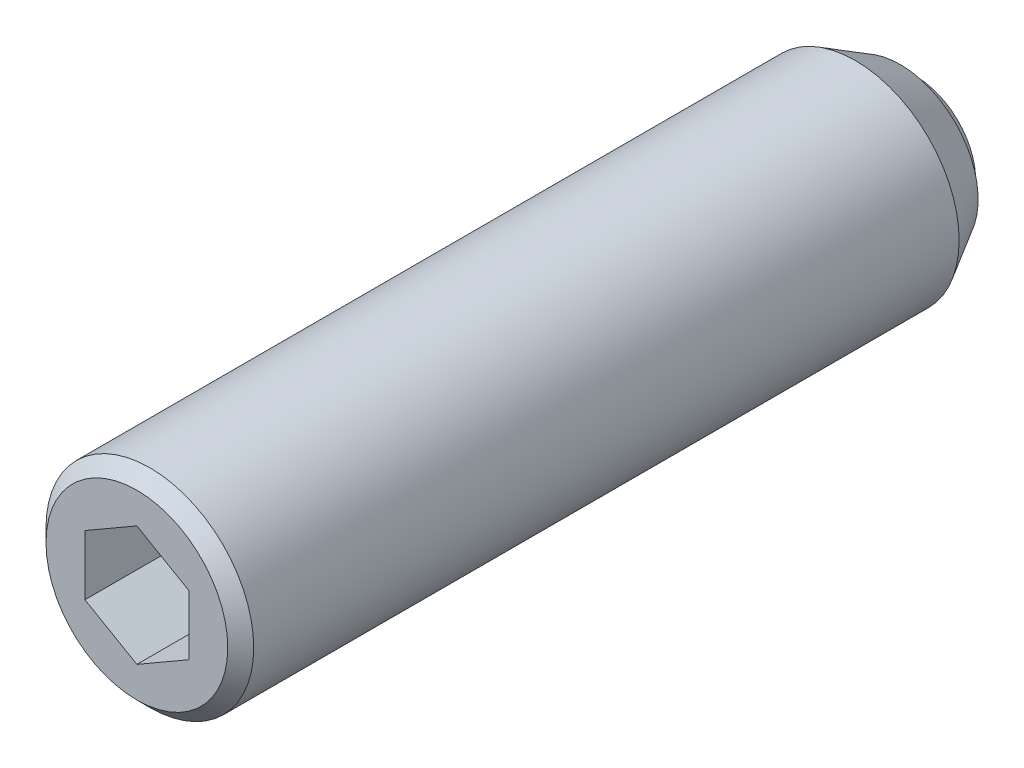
ISO-10303-21;
HEADER;
FILE_DESCRIPTION(('STEP AP214'),'2;1');
FILE_NAME('part.step','',(''),(''),'','','');
FILE_SCHEMA(('AUTOMOTIVE_DESIGN { 1 0 10303 214 1 1 1 1 }'));
ENDSEC;
DATA;
#1=APPLICATION_CONTEXT('core data for automotive mechanical design processes');
#2=APPLICATION_PROTOCOL_DEFINITION('international standard','automotive_design',2000,#1);
#3=PRODUCT_CONTEXT('',#1,'mechanical');
#4=PRODUCT('Part','Part','',(#3));
#5=PRODUCT_RELATED_PRODUCT_CATEGORY('part','',(#4));
#6=PRODUCT_DEFINITION_FORMATION('','',#4);
#7=PRODUCT_DEFINITION_CONTEXT('part definition',#1,'design');
#8=PRODUCT_DEFINITION('design','',#6,#7);
#9=PRODUCT_DEFINITION_SHAPE('','',#8);
#10=(LENGTH_UNIT() NAMED_UNIT(*) SI_UNIT(.MILLI.,.METRE.));
#11=(NAMED_UNIT(*) PLANE_ANGLE_UNIT() SI_UNIT($,.RADIAN.));
#12=(NAMED_UNIT(*) SI_UNIT($,.STERADIAN.) SOLID_ANGLE_UNIT());
#13=UNCERTAINTY_MEASURE_WITH_UNIT(LENGTH_MEASURE(1.E-05),#10,'distance_accuracy_value','');
#14=(GEOMETRIC_REPRESENTATION_CONTEXT(3) GLOBAL_UNCERTAINTY_ASSIGNED_CONTEXT((#13)) GLOBAL_UNIT_ASSIGNED_CONTEXT((#10,
#11,#12)) REPRESENTATION_CONTEXT('',''));
#15=CARTESIAN_POINT('',(0.,0.,0.));
#16=DIRECTION('',(0.,0.,1.));
#17=DIRECTION('',(1.,0.,0.));
#18=AXIS2_PLACEMENT_3D('',#15,#16,#17);
#19=CARTESIAN_POINT('',(2.,1.15470053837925,27.5));
#20=DIRECTION('',(0.5,0.86602540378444,0.));
#21=DIRECTION('',(0.86602540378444,-0.5,0.));
#22=AXIS2_PLACEMENT_3D('',#19,#20,#21);
#23=PLANE('',#22);
#24=DIRECTION('',(0.,0.,1.));
#25=VECTOR('',#24,1.);
#26=CARTESIAN_POINT('',(2.,1.15470053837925,27.5));
#27=LINE('',#26,#25);
#28=CARTESIAN_POINT('',(2.,1.15470053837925,26.));
#29=VERTEX_POINT('',#28);
#30=CARTESIAN_POINT('',(2.,1.15470053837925,30.));
#31=VERTEX_POINT('',#30);
#32=EDGE_CURVE('E68',#29,#31,#27,.T.);
#33=ORIENTED_EDGE('',*,*,#32,.T.);
#34=DIRECTION('',(-0.86602540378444,0.5,0.));
#35=VECTOR('',#34,1.);
#36=CARTESIAN_POINT('',(2.,1.15470053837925,30.));
#37=LINE('',#36,#35);
#38=CARTESIAN_POINT('',(0.,2.3094010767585,30.));
#39=VERTEX_POINT('',#38);
#40=EDGE_CURVE('E29',#31,#39,#37,.T.);
#41=ORIENTED_EDGE('',*,*,#40,.T.);
#42=DIRECTION('',(0.,0.,1.));
#43=VECTOR('',#42,1.);
#44=CARTESIAN_POINT('',(0.,2.3094010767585,27.5));
#45=LINE('',#44,#43);
#46=CARTESIAN_POINT('',(0.,2.3094010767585,26.));
#47=VERTEX_POINT('',#46);
#48=EDGE_CURVE('E80',#47,#39,#45,.T.);
#49=ORIENTED_EDGE('',*,*,#48,.F.);
#50=DIRECTION('',(-0.86602540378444,0.5,0.));
#51=VECTOR('',#50,1.);
#52=CARTESIAN_POINT('',(2.,1.15470053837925,26.));
#53=LINE('',#52,#51);
#54=EDGE_CURVE('E79',#29,#47,#53,.T.);
#55=ORIENTED_EDGE('',*,*,#54,.F.);
#56=EDGE_LOOP('',(#33,#41,#49,#55));
#57=FACE_BOUND('',#56,.T.);
#58=ADVANCED_FACE('F14',(#57),#23,.F.);
#59=CARTESIAN_POINT('',(2.,-1.15470053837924,27.5));
#60=DIRECTION('',(1.,0.,0.));
#61=DIRECTION('',(0.,0.,1.));
#62=AXIS2_PLACEMENT_3D('',#59,#60,#61);
#63=PLANE('',#62);
#64=DIRECTION('',(0.,0.,1.));
#65=VECTOR('',#64,1.);
#66=CARTESIAN_POINT('',(2.,-1.15470053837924,27.5));
#67=LINE('',#66,#65);
#68=CARTESIAN_POINT('',(2.,-1.15470053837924,26.));
#69=VERTEX_POINT('',#68);
#70=CARTESIAN_POINT('',(2.,-1.15470053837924,30.));
#71=VERTEX_POINT('',#70);
#72=EDGE_CURVE('E76',#69,#71,#67,.T.);
#73=ORIENTED_EDGE('',*,*,#72,.T.);
#74=DIRECTION('',(0.,1.,0.));
#75=VECTOR('',#74,1.);
#76=CARTESIAN_POINT('',(2.,-1.15470053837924,30.));
#77=LINE('',#76,#75);
#78=EDGE_CURVE('E75',#71,#31,#77,.T.);
#79=ORIENTED_EDGE('',*,*,#78,.T.);
#80=ORIENTED_EDGE('',*,*,#32,.F.);
#81=DIRECTION('',(0.,1.,0.));
#82=VECTOR('',#81,1.);
#83=CARTESIAN_POINT('',(2.,-1.15470053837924,26.));
#84=LINE('',#83,#82);
#85=EDGE_CURVE('E72',#69,#29,#84,.T.);
#86=ORIENTED_EDGE('',*,*,#85,.F.);
#87=EDGE_LOOP('',(#73,#79,#80,#86));
#88=FACE_BOUND('',#87,.T.);
#89=ADVANCED_FACE('F70',(#88),#63,.F.);
#90=CARTESIAN_POINT('',(2.,-1.15470053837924,27.5));
#91=DIRECTION('',(-0.5,0.866025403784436,0.));
#92=DIRECTION('',(0.866025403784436,0.5,0.));
#93=AXIS2_PLACEMENT_3D('',#90,#91,#92);
#94=PLANE('',#93);
#95=DIRECTION('',(0.,0.,1.));
#96=VECTOR('',#95,1.);
#97=CARTESIAN_POINT('',(0.,-2.30940107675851,27.5));
#98=LINE('',#97,#96);
#99=CARTESIAN_POINT('',(0.,-2.30940107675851,26.));
#100=VERTEX_POINT('',#99);
#101=CARTESIAN_POINT('',(0.,-2.30940107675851,30.));
#102=VERTEX_POINT('',#101);
#103=EDGE_CURVE('E122',#100,#102,#98,.T.);
#104=ORIENTED_EDGE('',*,*,#103,.T.);
#105=DIRECTION('',(-0.866025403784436,-0.5,0.));
#106=VECTOR('',#105,1.);
#107=CARTESIAN_POINT('',(2.,-1.15470053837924,30.));
#108=LINE('',#107,#106);
#109=EDGE_CURVE('E113',#71,#102,#108,.T.);
#110=ORIENTED_EDGE('',*,*,#109,.F.);
#111=ORIENTED_EDGE('',*,*,#72,.F.);
#112=DIRECTION('',(0.866025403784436,0.5,0.));
#113=VECTOR('',#112,1.);
#114=CARTESIAN_POINT('',(0.,-2.30940107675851,26.));
#115=LINE('',#114,#113);
#116=EDGE_CURVE('E89',#100,#69,#115,.T.);
#117=ORIENTED_EDGE('',*,*,#116,.F.);
#118=EDGE_LOOP('',(#104,#110,#111,#117));
#119=FACE_BOUND('',#118,.T.);
#120=ADVANCED_FACE('F147',(#119),#94,.T.);
#121=CARTESIAN_POINT('',(-2.,-1.15470053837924,27.5));
#122=DIRECTION('',(-0.5,-0.866025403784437,0.));
#123=DIRECTION('',(-0.866025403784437,0.5,0.));
#124=AXIS2_PLACEMENT_3D('',#121,#122,#123);
#125=PLANE('',#124);
#126=DIRECTION('',(0.,0.,1.));
#127=VECTOR('',#126,1.);
#128=CARTESIAN_POINT('',(-2.,-1.15470053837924,27.5));
#129=LINE('',#128,#127);
#130=CARTESIAN_POINT('',(-2.,-1.15470053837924,26.));
#131=VERTEX_POINT('',#130);
#132=CARTESIAN_POINT('',(-2.,-1.15470053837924,30.));
#133=VERTEX_POINT('',#132);
#134=EDGE_CURVE('E120',#131,#133,#129,.T.);
#135=ORIENTED_EDGE('',*,*,#134,.T.);
#136=DIRECTION('',(0.866025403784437,-0.5,0.));
#137=VECTOR('',#136,1.);
#138=CARTESIAN_POINT('',(-2.,-1.15470053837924,30.));
#139=LINE('',#138,#137);
#140=EDGE_CURVE('E111',#133,#102,#139,.T.);
#141=ORIENTED_EDGE('',*,*,#140,.T.);
#142=ORIENTED_EDGE('',*,*,#103,.F.);
#143=DIRECTION('',(0.866025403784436,-0.5,0.));
#144=VECTOR('',#143,1.);
#145=CARTESIAN_POINT('',(-2.,-1.15470053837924,26.));
#146=LINE('',#145,#144);
#147=EDGE_CURVE('E101',#131,#100,#146,.T.);
#148=ORIENTED_EDGE('',*,*,#147,.F.);
#149=EDGE_LOOP('',(#135,#141,#142,#148));
#150=FACE_BOUND('',#149,.T.);
#151=ADVANCED_FACE('F157',(#150),#125,.F.);
#152=CARTESIAN_POINT('',(-2.,-1.15470053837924,27.5));
#153=DIRECTION('',(1.,0.,0.));
#154=DIRECTION('',(0.,0.,1.));
#155=AXIS2_PLACEMENT_3D('',#152,#153,#154);
#156=PLANE('',#155);
#157=DIRECTION('',(0.,0.,1.));
#158=VECTOR('',#157,1.);
#159=CARTESIAN_POINT('',(-2.,1.15470053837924,27.5));
#160=LINE('',#159,#158);
#161=CARTESIAN_POINT('',(-2.,1.15470053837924,26.));
#162=VERTEX_POINT('',#161);
#163=CARTESIAN_POINT('',(-2.,1.15470053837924,30.));
#164=VERTEX_POINT('',#163);
#165=EDGE_CURVE('E37',#162,#164,#160,.T.);
#166=ORIENTED_EDGE('',*,*,#165,.T.);
#167=DIRECTION('',(0.,1.,0.));
#168=VECTOR('',#167,1.);
#169=CARTESIAN_POINT('',(-2.,-1.15470053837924,30.));
#170=LINE('',#169,#168);
#171=EDGE_CURVE('E108',#133,#164,#170,.T.);
#172=ORIENTED_EDGE('',*,*,#171,.F.);
#173=ORIENTED_EDGE('',*,*,#134,.F.);
#174=DIRECTION('',(0.,-1.,0.));
#175=VECTOR('',#174,1.);
#176=CARTESIAN_POINT('',(-2.,1.15470053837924,26.));
#177=LINE('',#176,#175);
#178=EDGE_CURVE('E98',#162,#131,#177,.T.);
#179=ORIENTED_EDGE('',*,*,#178,.F.);
#180=EDGE_LOOP('',(#166,#172,#173,#179));
#181=FACE_BOUND('',#180,.T.);
#182=ADVANCED_FACE('F153',(#181),#156,.T.);
#183=CARTESIAN_POINT('',(-2.,1.15470053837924,27.5));
#184=DIRECTION('',(0.5,-0.866025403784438,0.));
#185=DIRECTION('',(-0.866025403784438,-0.5,0.));
#186=AXIS2_PLACEMENT_3D('',#183,#184,#185);
#187=PLANE('',#186);
#188=ORIENTED_EDGE('',*,*,#165,.F.);
#189=DIRECTION('',(-0.866025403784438,-0.5,0.));
#190=VECTOR('',#189,1.);
#191=CARTESIAN_POINT('',(0.,2.3094010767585,26.));
#192=LINE('',#191,#190);
#193=EDGE_CURVE('E84',#47,#162,#192,.T.);
#194=ORIENTED_EDGE('',*,*,#193,.F.);
#195=ORIENTED_EDGE('',*,*,#48,.T.);
#196=DIRECTION('',(0.866025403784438,0.5,0.));
#197=VECTOR('',#196,1.);
#198=CARTESIAN_POINT('',(-2.,1.15470053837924,30.));
#199=LINE('',#198,#197);
#200=EDGE_CURVE('E105',#164,#39,#199,.T.);
#201=ORIENTED_EDGE('',*,*,#200,.F.);
#202=EDGE_LOOP('',(#188,#194,#195,#201));
#203=FACE_BOUND('',#202,.T.);
#204=ADVANCED_FACE('F150',(#203),#187,.T.);
#205=CARTESIAN_POINT('',(0.,0.,29.75));
#206=DIRECTION('',(0.,0.,-1.));
#207=DIRECTION('',(1.,0.,0.));
#208=AXIS2_PLACEMENT_3D('',#205,#206,#207);
#209=CYLINDRICAL_SURFACE('',#208,4.);
#210=CARTESIAN_POINT('',(0.,0.,29.5));
#211=DIRECTION('',(0.,0.,-1.));
#212=DIRECTION('',(1.,0.,0.));
#213=AXIS2_PLACEMENT_3D('',#210,#211,#212);
#214=CIRCLE('',#213,4.);
#215=CARTESIAN_POINT('',(4.,0.,29.5));
#216=VERTEX_POINT('',#215);
#217=EDGE_CURVE('E9',#216,#216,#214,.T.);
#218=ORIENTED_EDGE('',*,*,#217,.T.);
#219=EDGE_LOOP('',(#218));
#220=FACE_BOUND('',#219,.T.);
#221=CARTESIAN_POINT('',(0.,0.,2.33205080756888));
#222=DIRECTION('',(0.,0.,-1.));
#223=DIRECTION('',(-1.,0.,0.));
#224=AXIS2_PLACEMENT_3D('',#221,#222,#223);
#225=CIRCLE('',#224,4.);
#226=CARTESIAN_POINT('',(-4.,0.,2.33205080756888));
#227=VERTEX_POINT('',#226);
#228=EDGE_CURVE('E260',#227,#227,#225,.T.);
#229=ORIENTED_EDGE('',*,*,#228,.F.);
#230=EDGE_LOOP('',(#229));
#231=FACE_BOUND('',#230,.T.);
#232=ADVANCED_FACE('F16',(#220,#231),#209,.T.);
#233=CARTESIAN_POINT('',(0.,0.,29.5));
#234=DIRECTION('',(0.,0.,-1.));
#235=DIRECTION('',(1.,0.,0.));
#236=AXIS2_PLACEMENT_3D('',#233,#234,#235);
#237=CONICAL_SURFACE('',#236,4.,0.785398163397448);
#238=CARTESIAN_POINT('',(0.,0.,30.));
#239=DIRECTION('',(0.,0.,-1.));
#240=DIRECTION('',(1.,0.,0.));
#241=AXIS2_PLACEMENT_3D('',#238,#239,#240);
#242=CIRCLE('',#241,3.5);
#243=CARTESIAN_POINT('',(3.5,0.,30.));
#244=VERTEX_POINT('',#243);
#245=EDGE_CURVE('E22',#244,#244,#242,.T.);
#246=ORIENTED_EDGE('',*,*,#245,.T.);
#247=EDGE_LOOP('',(#246));
#248=FACE_BOUND('',#247,.T.);
#249=ORIENTED_EDGE('',*,*,#217,.F.);
#250=EDGE_LOOP('',(#249));
#251=FACE_BOUND('',#250,.T.);
#252=ADVANCED_FACE('F127',(#248,#251),#237,.T.);
#253=CARTESIAN_POINT('',(0.,0.,30.));
#254=DIRECTION('',(0.,0.,-1.));
#255=DIRECTION('',(1.,0.,0.));
#256=AXIS2_PLACEMENT_3D('',#253,#254,#255);
#257=PLANE('',#256);
#258=ORIENTED_EDGE('',*,*,#200,.T.);
#259=ORIENTED_EDGE('',*,*,#40,.F.);
#260=ORIENTED_EDGE('',*,*,#78,.F.);
#261=ORIENTED_EDGE('',*,*,#109,.T.);
#262=ORIENTED_EDGE('',*,*,#140,.F.);
#263=ORIENTED_EDGE('',*,*,#171,.T.);
#264=EDGE_LOOP('',(#258,#259,#260,#261,#262,#263));
#265=FACE_BOUND('',#264,.T.);
#266=ORIENTED_EDGE('',*,*,#245,.F.);
#267=EDGE_LOOP('',(#266));
#268=FACE_BOUND('',#267,.T.);
#269=ADVANCED_FACE('F130',(#265,#268),#257,.F.);
#270=CARTESIAN_POINT('',(2.,1.15470053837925,26.));
#271=DIRECTION('',(0.,0.,1.));
#272=DIRECTION('',(1.,0.,0.));
#273=AXIS2_PLACEMENT_3D('',#270,#271,#272);
#274=PLANE('',#273);
#275=ORIENTED_EDGE('',*,*,#85,.T.);
#276=ORIENTED_EDGE('',*,*,#54,.T.);
#277=ORIENTED_EDGE('',*,*,#193,.T.);
#278=ORIENTED_EDGE('',*,*,#178,.T.);
#279=ORIENTED_EDGE('',*,*,#147,.T.);
#280=ORIENTED_EDGE('',*,*,#116,.T.);
#281=EDGE_LOOP('',(#275,#276,#277,#278,#279,#280));
#282=FACE_BOUND('',#281,.T.);
#283=ADVANCED_FACE('F86',(#282),#274,.T.);
#284=CARTESIAN_POINT('',(0.,0.,0.));
#285=DIRECTION('',(0.,0.,-1.));
#286=DIRECTION('',(-1.,0.,0.));
#287=AXIS2_PLACEMENT_3D('',#284,#285,#286);
#288=PLANE('',#287);
#289=CARTESIAN_POINT('',(0.,0.,0.));
#290=DIRECTION('',(0.,0.,-1.));
#291=DIRECTION('',(-1.,0.,0.));
#292=AXIS2_PLACEMENT_3D('',#289,#290,#291);
#293=CIRCLE('',#292,2.30488611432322);
#294=CARTESIAN_POINT('',(-2.30488611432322,0.,0.));
#295=VERTEX_POINT('',#294);
#296=EDGE_CURVE('E90',#295,#295,#293,.T.);
#297=ORIENTED_EDGE('',*,*,#296,.T.);
#298=EDGE_LOOP('',(#297));
#299=FACE_BOUND('',#298,.T.);
#300=ADVANCED_FACE('F139',(#299),#288,.T.);
#301=CARTESIAN_POINT('',(0.,0.,1.5));
#302=DIRECTION('',(0.,0.,-1.));
#303=DIRECTION('',(-1.,0.,0.));
#304=AXIS2_PLACEMENT_3D('',#301,#302,#303);
#305=SPHERICAL_SURFACE('',#304,2.75);
#306=CARTESIAN_POINT('',(0.,0.,0.6));
#307=DIRECTION('',(0.,0.,-1.));
#308=DIRECTION('',(-1.,0.,0.));
#309=AXIS2_PLACEMENT_3D('',#306,#307,#308);
#310=CIRCLE('',#309,2.59855729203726);
#311=CARTESIAN_POINT('',(-2.59855729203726,0.,0.6));
#312=VERTEX_POINT('',#311);
#313=EDGE_CURVE('E93',#312,#312,#310,.T.);
#314=CARTESIAN_POINT('',(-2.59855729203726,0.,0.6));
#315=CARTESIAN_POINT('',(-2.59627433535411,0.,0.593408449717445));
#316=CARTESIAN_POINT('',(-2.59396629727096,0.,0.586825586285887));
#317=CARTESIAN_POINT('',(-2.58930019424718,0.,0.573677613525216));
#318=CARTESIAN_POINT('',(-2.58694212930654,0.,0.567112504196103));
#319=CARTESIAN_POINT('',(-2.58217610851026,0.,0.55400042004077));
#320=CARTESIAN_POINT('',(-2.57976815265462,0.,0.54745344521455));
#321=CARTESIAN_POINT('',(-2.57490248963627,0.,0.534378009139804));
#322=CARTESIAN_POINT('',(-2.57244478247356,0.,0.527849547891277));
#323=CARTESIAN_POINT('',(-2.56747975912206,0.,0.514811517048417));
#324=CARTESIAN_POINT('',(-2.56497244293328,0.,0.508301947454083));
#325=CARTESIAN_POINT('',(-2.55990834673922,0.,0.495302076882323));
#326=CARTESIAN_POINT('',(-2.55735156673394,0.,0.488811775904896));
#327=CARTESIAN_POINT('',(-2.55218869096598,0.,0.475850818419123));
#328=CARTESIAN_POINT('',(-2.54958259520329,0.,0.469380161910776));
#329=CARTESIAN_POINT('',(-2.54432123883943,0.,0.456458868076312));
#330=CARTESIAN_POINT('',(-2.54166597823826,0.,0.450008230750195));
#331=CARTESIAN_POINT('',(-2.53630644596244,0.,0.437127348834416));
#332=CARTESIAN_POINT('',(-2.53360217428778,0.,0.430697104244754));
#333=CARTESIAN_POINT('',(-2.52814477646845,0.,0.417857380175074));
#334=CARTESIAN_POINT('',(-2.52539165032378,0.,0.411447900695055));
#335=CARTESIAN_POINT('',(-2.51983670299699,0.,0.398650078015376));
#336=CARTESIAN_POINT('',(-2.51703488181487,0.,0.392261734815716));
#337=CARTESIAN_POINT('',(-2.51138270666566,0.,0.379506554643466));
#338=CARTESIAN_POINT('',(-2.50853235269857,0.,0.373139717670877));
#339=CARTESIAN_POINT('',(-2.50278327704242,0.,0.360427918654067));
#340=CARTESIAN_POINT('',(-2.49988455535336,0.,0.354082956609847));
#341=CARTESIAN_POINT('',(-2.49403891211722,0.,0.3414152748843));
#342=CARTESIAN_POINT('',(-2.49109199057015,0.,0.335092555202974));
#343=CARTESIAN_POINT('',(-2.48515011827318,0.,0.322469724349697));
#344=CARTESIAN_POINT('',(-2.48215516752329,0.,0.316169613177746));
#345=CARTESIAN_POINT('',(-2.47611741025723,0.,0.303592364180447));
#346=CARTESIAN_POINT('',(-2.47307460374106,0.,0.2973152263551));
#347=CARTESIAN_POINT('',(-2.46694131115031,0.,0.284784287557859));
#348=CARTESIAN_POINT('',(-2.46385082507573,0.,0.278530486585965));
#349=CARTESIAN_POINT('',(-2.45762235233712,0.,0.266046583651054));
#350=CARTESIAN_POINT('',(-2.45448436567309,0.,0.259816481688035));
#351=CARTESIAN_POINT('',(-2.44816107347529,0.,0.247380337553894));
#352=CARTESIAN_POINT('',(-2.44497576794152,0.,0.241174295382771));
#353=CARTESIAN_POINT('',(-2.43855802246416,0.,0.228786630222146));
#354=CARTESIAN_POINT('',(-2.43532558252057,0.,0.222605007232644));
#355=CARTESIAN_POINT('',(-2.42881375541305,0.,0.210266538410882));
#356=CARTESIAN_POINT('',(-2.42553436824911,0.,0.204109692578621));
#357=CARTESIAN_POINT('',(-2.41892883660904,0.,0.191821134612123));
#358=CARTESIAN_POINT('',(-2.41560269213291,0.,0.185689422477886));
#359=CARTESIAN_POINT('',(-2.40890383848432,0.,0.173451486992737));
#360=CARTESIAN_POINT('',(-2.40553112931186,0.,0.167345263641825));
#361=CARTESIAN_POINT('',(-2.39873934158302,0.,0.155158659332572));
#362=CARTESIAN_POINT('',(-2.39532026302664,0.,0.149078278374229));
#363=CARTESIAN_POINT('',(-2.38843593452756,0.,0.136943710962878));
#364=CARTESIAN_POINT('',(-2.38497068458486,0.,0.13088952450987));
#365=CARTESIAN_POINT('',(-2.37799421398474,0.,0.11880769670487));
#366=CARTESIAN_POINT('',(-2.37448299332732,0.,0.11278005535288));
#367=CARTESIAN_POINT('',(-2.36741478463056,0.,0.100751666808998));
#368=CARTESIAN_POINT('',(-2.36385779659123,0.,0.094750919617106));
#369=CARTESIAN_POINT('',(-2.35669825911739,0.,0.0827766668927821));
#370=CARTESIAN_POINT('',(-2.35309570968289,0.,0.0768031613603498));
#371=CARTESIAN_POINT('',(-2.34584525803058,0.,0.0648837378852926));
#372=CARTESIAN_POINT('',(-2.34219735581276,0.,0.0589378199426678));
#373=CARTESIAN_POINT('',(-2.33485640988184,0.,0.0470739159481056));
#374=CARTESIAN_POINT('',(-2.33116336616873,0.,0.0411559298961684));
#375=CARTESIAN_POINT('',(-2.32373235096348,0.,0.0293482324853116));
#376=CARTESIAN_POINT('',(-2.31999437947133,0.,0.023458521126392));
#377=CARTESIAN_POINT('',(-2.31247372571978,0.,0.0117077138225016));
#378=CARTESIAN_POINT('',(-2.30869104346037,0.,0.00584661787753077));
#379=CARTESIAN_POINT('',(-2.30488611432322,0.,0.));
#380=B_SPLINE_CURVE_WITH_KNOTS('',3,(#314,#315,#316,#317,#318,#319,#320,#321,#322,#323,#324,
#325,#326,#327,#328,#329,#330,#331,#332,#333,#334,#335,#336,#337,#338,#339,#340,#341,#342,#343,
#344,#345,#346,#347,#348,#349,#350,#351,#352,#353,#354,#355,#356,#357,#358,#359,#360,#361,#362,
#363,#364,#365,#366,#367,#368,#369,#370,#371,#372,#373,#374,#375,#376,#377,#378,#379),
.UNSPECIFIED.,.F.,.F.,(4,2,2,2,2,2,2,2,2,2,2,2,2,2,2,2,2,2,2,2,2,2,2,2,2,2,2,2,2,2,2,2,4),(0.,
0.0209270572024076,0.0418541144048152,0.0627811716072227,0.0837082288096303,0.104635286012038,
0.125562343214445,0.146489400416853,0.16741645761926,0.188343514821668,0.209270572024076,
0.230197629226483,0.251124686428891,0.272051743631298,0.292978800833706,0.313905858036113,
0.334832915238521,0.355759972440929,0.376687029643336,0.397614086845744,0.418541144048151,
0.439468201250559,0.460395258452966,0.481322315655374,0.502249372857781,0.523176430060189,
0.544103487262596,0.565030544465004,0.585957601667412,0.606884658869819,0.627811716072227,
0.648738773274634,0.669665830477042),.UNSPECIFIED.);
#381=EDGE_CURVE('BSEAM223',#312,#295,#380,.T.);
#382=ORIENTED_EDGE('',*,*,#313,.T.);
#383=ORIENTED_EDGE('',*,*,#296,.F.);
#384=ORIENTED_EDGE('',*,*,#381,.T.);
#385=ORIENTED_EDGE('',*,*,#381,.F.);
#386=EDGE_LOOP('',(#382,#384,#383,#385));
#387=FACE_BOUND('',#386,.T.);
#388=ADVANCED_FACE('F223',(#387),#305,.T.);
#389=CARTESIAN_POINT('',(-2.59855729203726,0.,0.6));
#390=DIRECTION('',(0.,0.,-1.));
#391=DIRECTION('',(-1.,0.,0.));
#392=AXIS2_PLACEMENT_3D('',#389,#390,#391);
#393=PLANE('',#392);
#394=CARTESIAN_POINT('',(0.,0.,0.6));
#395=DIRECTION('',(0.,0.,-1.));
#396=DIRECTION('',(-1.,0.,0.));
#397=AXIS2_PLACEMENT_3D('',#394,#395,#396);
#398=CIRCLE('',#397,3.);
#399=CARTESIAN_POINT('',(-3.,0.,0.6));
#400=VERTEX_POINT('',#399);
#401=EDGE_CURVE('E263',#400,#400,#398,.T.);
#402=ORIENTED_EDGE('',*,*,#401,.T.);
#403=EDGE_LOOP('',(#402));
#404=FACE_BOUND('',#403,.T.);
#405=ORIENTED_EDGE('',*,*,#313,.F.);
#406=EDGE_LOOP('',(#405));
#407=FACE_BOUND('',#406,.T.);
#408=ADVANCED_FACE('F232',(#404,#407),#393,.T.);
#409=CARTESIAN_POINT('',(0.,0.,0.6));
#410=DIRECTION('',(0.,0.,1.));
#411=DIRECTION('',(1.,0.,0.));
#412=AXIS2_PLACEMENT_3D('',#409,#410,#411);
#413=CONICAL_SURFACE('',#412,3.,0.523598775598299);
#414=ORIENTED_EDGE('',*,*,#228,.T.);
#415=EDGE_LOOP('',(#414));
#416=FACE_BOUND('',#415,.T.);
#417=ORIENTED_EDGE('',*,*,#401,.F.);
#418=EDGE_LOOP('',(#417));
#419=FACE_BOUND('',#418,.T.);
#420=ADVANCED_FACE('F242',(#416,#419),#413,.T.);
#421=CLOSED_SHELL('',(#58,#89,#120,#151,#182,#204,#232,#252,#269,#283,#300,#388,#408,#420));
#422=MANIFOLD_SOLID_BREP('B1',#421);
#423=ADVANCED_BREP_SHAPE_REPRESENTATION('',(#18,#422),#14);
#424=SHAPE_DEFINITION_REPRESENTATION(#9,#423);
ENDSEC;
END-ISO-10303-21;
